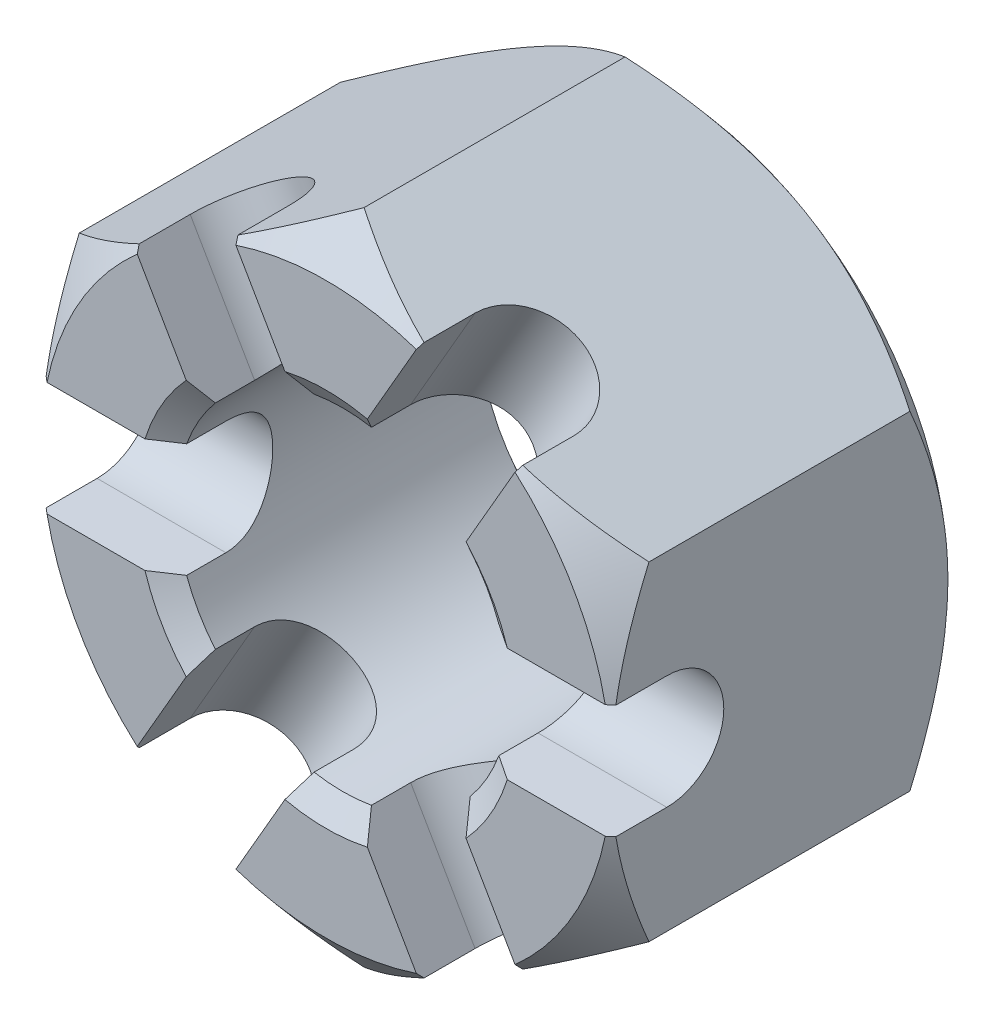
from build123d import *

# Parameters (mm, degrees)
BASENUT_START     = -22.5298
BASENUTSKE_R      = 11.1125
BASENUT_DEPTH     = 22.5298
SLOT_DEPTH        = 50.427440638
SLOTPATTERN_COUNT = 3
SLOTPATTERN_ANGLE = 120


with BuildPart() as part:
    # BaseNutSke → BaseNut (new body)
    with BuildSketch(Plane.XY.offset(BASENUT_START)):
        Polygon((19.05, 10.998522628), (19.05, -10.998522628), (0, -21.997045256), (-19.05, -10.998522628), (-19.05, 10.998522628), (0, 21.997045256), align=None)
        Circle(BASENUTSKE_R, mode=Mode.SUBTRACT)
    extrude(amount=BASENUT_DEPTH)

    # Sketch4 → Slot (cut, through all)
    with BuildSketch(Plane(origin=(19.05, 0, 0), x_dir=(0, 0, -1), z_dir=(1, 0, 0))):
        with BuildLine():
            Line((3.7338, 3.81), (0, 3.81))
            Line((0, 3.81), (0, -3.81))
            Line((0, -3.81), (3.7338, -3.81))
            ThreePointArc((3.7338, -3.81), (7.5438, 0), (3.7338, 3.81))
        make_face()
    slot = extrude(amount=-SLOT_DEPTH, mode=Mode.SUBTRACT)

    # SlotPattern: Slot ×3 about axis
    slotpattern_axis = Axis((0, 0, 0), (0, 0, 1))
    for i in range(1, SLOTPATTERN_COUNT):
        add(slot.rotate(slotpattern_axis, i * SLOTPATTERN_ANGLE / (SLOTPATTERN_COUNT - 1)), mode=Mode.SUBTRACT)

    # Sketch3 → Double-Chamfer (revolve, cut)
    with BuildSketch(Plane(origin=(0, 0, 0), x_dir=(0, 0, -1), z_dir=(1, 0, 0)), mode=Mode.PRIVATE) as double_chamfer_sk:
        Polygon((22.5298, 19.05), (19.9898, 21.997045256), (19.9898, 34.697045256), (35.2298, 34.697045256), (35.2298, 19.05), align=None)
        Polygon((2.54, 21.997045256), (2.54, 34.697045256), (-12.7, 34.697045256), (-12.7, 19.05), (0, 19.05), align=None)
    revolve(double_chamfer_sk.sketch.rotate(Axis((0, 0, 0), (0, 0, -1)), 90), axis=Axis((0, 0, 0), (0, 0, -1)), mode=Mode.SUBTRACT)

    # EndChamferSketch → EndChamfer (revolve, cut)
    with BuildSketch(Plane(origin=(0, 0, 0), x_dir=(0, 0, -1), z_dir=(1, 0, 0)), mode=Mode.PRIVATE) as endchamfer_sk:
        Polygon((22.5044, 12.7), (21.281662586, 10.95375), (22.5552, 10.95375), (22.5552, 12.7), align=None)
        Polygon((-0.0508, 12.7), (0, 12.7), (1.222737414, 10.95375), (-0.0508, 10.95375), align=None)
    revolve(endchamfer_sk.sketch.rotate(Axis((0, 0, -25.037505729), (0, 0, -1)), 69.948957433), axis=Axis((0, 0, -25.037505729), (0, 0, -1)), mode=Mode.SUBTRACT)


solid = part.part
